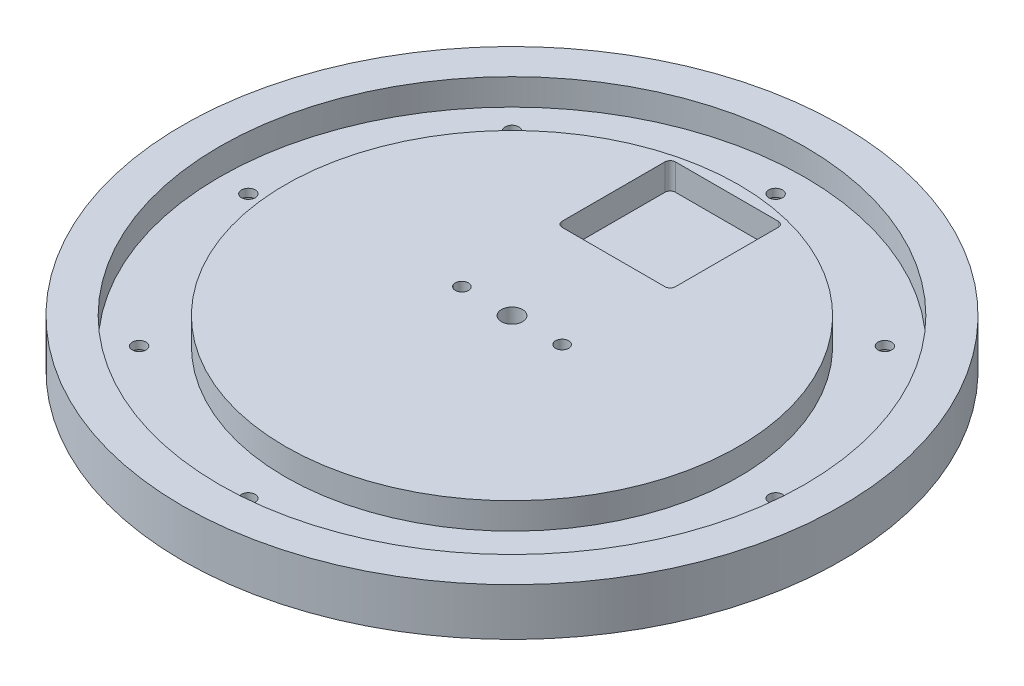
from build123d import *

# Parameters (mm, degrees)
SKETCH1_R               = 125
BOSS_EXTRUDE1_DEPTH     = 18
SKETCH2_R               = 111
SKETCH2_R_2             = 86
CUT_EXTRUDE1_DEPTH      = 10
SKETCH3_R               = 2.6
CUT_EXTRUDE2_DEPTH      = 10
SKETCH4_R               = 5
CUT_EXTRUDE3_DEPTH      = 5
CUT_EXTRUDE4_DEPTH      = 178.690742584
CUT_EXTRUDE4_DEPTH_BACK = 178.690742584
SKETCH5_R               = 4
SKETCH6_R               = 10
CUT_EXTRUDE5_DEPTH      = 8
SKETCH7_R               = 2.5
CUT_EXTRUDE6_DEPTH      = 178.690742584
SKETCH8_W               = 43
SKETCH8_H               = 43
CUT_EXTRUDE7_DEPTH      = 10
FILLET1_R               = 2


with BuildPart() as part:
    # Sketch1 → Boss-Extrude1 (new body)
    with BuildSketch(Plane(origin=(0, 0, 0), x_dir=(1, 0, 0), z_dir=(0, 1, 0))):
        with Locations(Location((0, 0, 0), (0, 0, 270))):
            Circle(SKETCH1_R)
    extrude(amount=BOSS_EXTRUDE1_DEPTH)

    # Sketch2 → Cut-Extrude1 (cut)
    with BuildSketch(Plane(origin=(0, 18, 0), x_dir=(1, 0, 0), z_dir=(0, 1, 0))):
        with Locations(Location((0, 0, 0), (0, 0, 270))):
            Circle(SKETCH2_R)
        with Locations(Location((0, 0, 0), (0, 0, 270))):
            Circle(SKETCH2_R_2, mode=Mode.SUBTRACT)
    extrude(amount=-CUT_EXTRUDE1_DEPTH, mode=Mode.SUBTRACT)

    # Sketch3 → Cut-Extrude2 (cut)
    with BuildSketch(Plane.XZ):
        with Locations(Location((100, 0, 0), (0, 0, 270))):
            Circle(SKETCH3_R)
        with Locations(Location((70.710678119, -70.710678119, 0), (0, 0, 270))):
            Circle(SKETCH3_R)
        with Locations(Location((0, -100, 0), (0, 0, 270))):
            Circle(SKETCH3_R)
        with Locations(Location((-70.710678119, -70.710678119, 0), (0, 0, 270))):
            Circle(SKETCH3_R)
        with Locations(Location((-100, 0, 0), (0, 0, 270))):
            Circle(SKETCH3_R)
        with Locations(Location((-70.710678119, 70.710678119, 0), (0, 0, 270))):
            Circle(SKETCH3_R)
        with Locations(Location((0, 100, 0), (0, 0, 270))):
            Circle(SKETCH3_R)
        with Locations(Location((70.710678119, 70.710678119, 0), (0, 0, 270))):
            Circle(SKETCH3_R)
    extrude(amount=-CUT_EXTRUDE2_DEPTH, mode=Mode.SUBTRACT)

    # Sketch4 → Cut-Extrude3 (cut)
    with BuildSketch(Plane.XZ):
        with Locations(Location((0, 100, 0), (0, 0, 270))):
            Circle(SKETCH4_R)
        with Locations(Location((70.710678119, 70.710678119, 0), (0, 0, 270))):
            Circle(SKETCH4_R)
        with Locations(Location((100, 0, 0), (0, 0, 270))):
            Circle(SKETCH4_R)
        with Locations(Location((70.710678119, -70.710678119, 0), (0, 0, 270))):
            Circle(SKETCH4_R)
        with Locations(Location((0, -100, 0), (0, 0, 270))):
            Circle(SKETCH4_R)
        with Locations(Location((-70.710678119, -70.710678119, 0), (0, 0, 270))):
            Circle(SKETCH4_R)
        with Locations(Location((-100, 0, 0), (0, 0, 270))):
            Circle(SKETCH4_R)
        with Locations(Location((-70.710678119, 70.710678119, 0), (0, 0, 270))):
            Circle(SKETCH4_R)
    extrude(amount=-CUT_EXTRUDE3_DEPTH, mode=Mode.SUBTRACT)

    # Sketch5 → Cut-Extrude4 (cut, two sides: drawn at the far end of the back side and taken through both)
    with BuildSketch(Plane(origin=(0, 18, 0), x_dir=(1, 0, 0), z_dir=(0, 1, 0)).offset(-CUT_EXTRUDE4_DEPTH_BACK)):
        with Locations(Location((0, 0, 0), (0, 0, 270))):
            Circle(SKETCH5_R)
    extrude(amount=CUT_EXTRUDE4_DEPTH + CUT_EXTRUDE4_DEPTH_BACK, mode=Mode.SUBTRACT)

    # Sketch6 → Cut-Extrude5 (cut)
    with BuildSketch(Plane.XZ):
        with Locations(Location((0, 0, 0), (0, 0, 270))):
            Circle(SKETCH6_R)
    extrude(amount=-CUT_EXTRUDE5_DEPTH, mode=Mode.SUBTRACT)

    # Sketch7 → Cut-Extrude6 (cut, through all)
    with BuildSketch(Plane(origin=(0, 18, 0), x_dir=(1, 0, 0), z_dir=(0, 1, 0))):
        with Locations(Location((19, 0, 0), (0, 0, 270))):
            Circle(SKETCH7_R)
        with Locations(Location((-19, 0, 0), (0, 0, 270))):
            Circle(SKETCH7_R)
    extrude(amount=-CUT_EXTRUDE6_DEPTH, mode=Mode.SUBTRACT)

    # Sketch8 → Cut-Extrude7 (cut)
    with BuildSketch(Plane(origin=(0, 18, 0), x_dir=(1, 0, 0), z_dir=(0, 1, 0))):
        with Locations((0, 60)):
            Rectangle(SKETCH8_W, SKETCH8_H)
    extrude(amount=-CUT_EXTRUDE7_DEPTH, mode=Mode.SUBTRACT)

    # Fillet1
    fillet1_edges = [part.edges().sort_by_distance(p)[0] for p in [
        (-21.5, 13, -38.5),
        (-21.5, 13, -81.5),
        (21.5, 13, -81.5),
        (21.5, 13, -38.5),
    ]]
    fillet(fillet1_edges, radius=FILLET1_R)


solid = part.part
